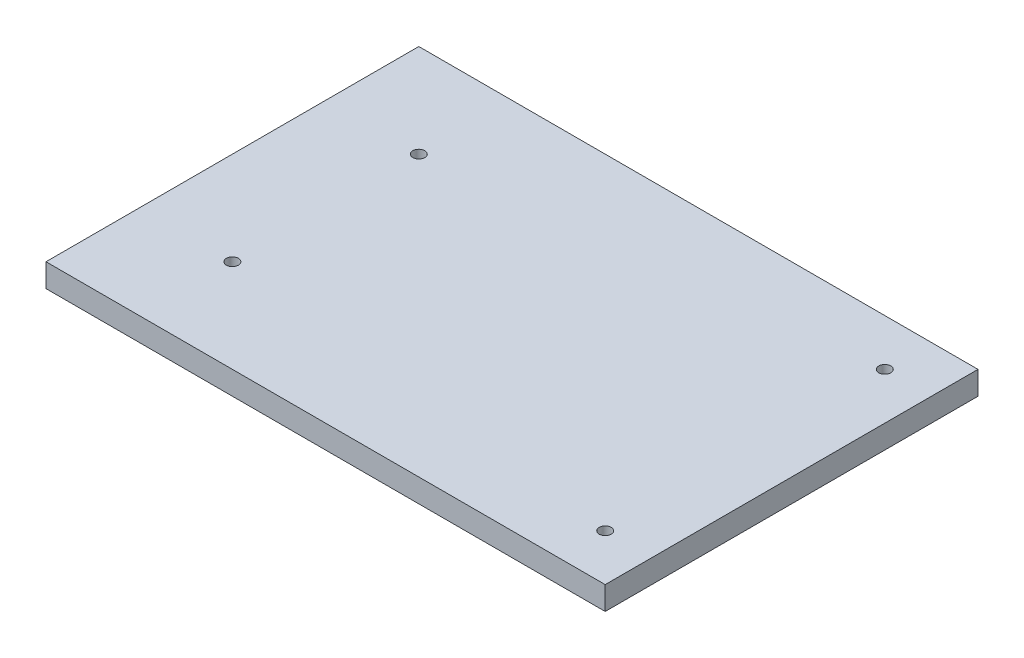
from build123d import *

# Parameters (mm, degrees)
SKETCH1_W                 = 152.4
SKETCH1_H                 = 101.6
EXTRUDE1_DEPTH            = 6.35
F_4_CLEARANCE_HOLE1_D     = 3.2639
F_4_CLEARANCE_HOLE1_DEPTH = 9.906
F_4_CLEARANCE_HOLE1_TIP   = 0.980574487


with BuildPart() as part:
    # Sketch1 → Extrude1 (new body)
    with BuildSketch(Plane(origin=(0, 0, 0), x_dir=(1, 0, 0), z_dir=(0, 1, 0))):
        with Locations((-91.981435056, -6.890282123)):
            Rectangle(SKETCH1_W, SKETCH1_H)
    extrude(amount=EXTRUDE1_DEPTH)

    # 4 Clearance Hole1
    with Locations(Plane(origin=(0, 6.35, 0), x_dir=(-1, 0, 0), z_dir=(0, 1, 0))):
        with Locations((142.781435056, -18.509717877), (142.781435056, 32.290282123), (28.481435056, 44.990282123), (28.481435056, -31.209717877)):
            Hole(F_4_CLEARANCE_HOLE1_D / 2, depth=F_4_CLEARANCE_HOLE1_DEPTH)
            with Locations((0, 0, -(F_4_CLEARANCE_HOLE1_DEPTH + F_4_CLEARANCE_HOLE1_TIP / 2))):  # 118° drill point
                Cone(0, F_4_CLEARANCE_HOLE1_D / 2, F_4_CLEARANCE_HOLE1_TIP, mode=Mode.SUBTRACT)


solid = part.part
